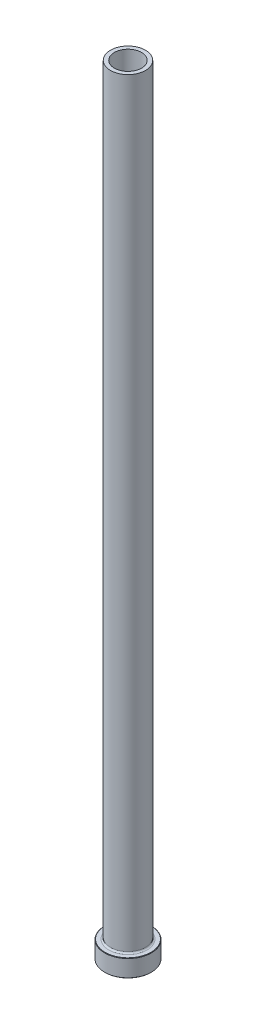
ISO-10303-21;
HEADER;
FILE_DESCRIPTION(('STEP AP214'),'2;1');
FILE_NAME('part.step','',(''),(''),'','','');
FILE_SCHEMA(('AUTOMOTIVE_DESIGN { 1 0 10303 214 1 1 1 1 }'));
ENDSEC;
DATA;
#1=APPLICATION_CONTEXT('core data for automotive mechanical design processes');
#2=APPLICATION_PROTOCOL_DEFINITION('international standard','automotive_design',2000,#1);
#3=PRODUCT_CONTEXT('',#1,'mechanical');
#4=PRODUCT('Part','Part','',(#3));
#5=PRODUCT_RELATED_PRODUCT_CATEGORY('part','',(#4));
#6=PRODUCT_DEFINITION_FORMATION('','',#4);
#7=PRODUCT_DEFINITION_CONTEXT('part definition',#1,'design');
#8=PRODUCT_DEFINITION('design','',#6,#7);
#9=PRODUCT_DEFINITION_SHAPE('','',#8);
#10=(LENGTH_UNIT() NAMED_UNIT(*) SI_UNIT(.MILLI.,.METRE.));
#11=(NAMED_UNIT(*) PLANE_ANGLE_UNIT() SI_UNIT($,.RADIAN.));
#12=(NAMED_UNIT(*) SI_UNIT($,.STERADIAN.) SOLID_ANGLE_UNIT());
#13=UNCERTAINTY_MEASURE_WITH_UNIT(LENGTH_MEASURE(1.E-05),#10,'distance_accuracy_value','');
#14=(GEOMETRIC_REPRESENTATION_CONTEXT(3) GLOBAL_UNCERTAINTY_ASSIGNED_CONTEXT((#13)) GLOBAL_UNIT_ASSIGNED_CONTEXT((#10,
#11,#12)) REPRESENTATION_CONTEXT('',''));
#15=CARTESIAN_POINT('',(0.,0.,0.));
#16=DIRECTION('',(0.,0.,1.));
#17=DIRECTION('',(1.,0.,0.));
#18=AXIS2_PLACEMENT_3D('',#15,#16,#17);
#19=CARTESIAN_POINT('',(0.,92.1876809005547,0.));
#20=DIRECTION('',(0.,1.,0.));
#21=DIRECTION('',(0.,0.,1.));
#22=AXIS2_PLACEMENT_3D('',#19,#20,#21);
#23=CYLINDRICAL_SURFACE('',#22,7.00000000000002);
#24=CARTESIAN_POINT('',(0.,400.,0.));
#25=DIRECTION('',(0.,1.,0.));
#26=DIRECTION('',(0.,0.,1.));
#27=AXIS2_PLACEMENT_3D('',#24,#25,#26);
#28=CIRCLE('',#27,7.00000000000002);
#29=CARTESIAN_POINT('',(0.,400.,7.00000000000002));
#30=VERTEX_POINT('',#29);
#31=EDGE_CURVE('E62',#30,#30,#28,.T.);
#32=ORIENTED_EDGE('',*,*,#31,.T.);
#33=EDGE_LOOP('',(#32));
#34=FACE_BOUND('',#33,.T.);
#35=CARTESIAN_POINT('',(0.,345.,0.));
#36=DIRECTION('',(0.,1.,0.));
#37=DIRECTION('',(0.,0.,1.));
#38=AXIS2_PLACEMENT_3D('',#35,#36,#37);
#39=CIRCLE('',#38,7.00000000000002);
#40=CARTESIAN_POINT('',(0.,345.,7.00000000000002));
#41=VERTEX_POINT('',#40);
#42=EDGE_CURVE('E71',#41,#41,#39,.T.);
#43=ORIENTED_EDGE('',*,*,#42,.F.);
#44=EDGE_LOOP('',(#43));
#45=FACE_BOUND('',#44,.T.);
#46=ADVANCED_FACE('F30',(#34,#45),#23,.F.);
#47=CARTESIAN_POINT('',(-7.00000000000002,400.,0.));
#48=DIRECTION('',(0.,1.,0.));
#49=DIRECTION('',(0.,0.,1.));
#50=AXIS2_PLACEMENT_3D('',#47,#48,#49);
#51=PLANE('',#50);
#52=CARTESIAN_POINT('',(0.,400.,0.));
#53=DIRECTION('',(0.,1.,0.));
#54=DIRECTION('',(0.,0.,1.));
#55=AXIS2_PLACEMENT_3D('',#52,#53,#54);
#56=CIRCLE('',#55,9.00000000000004);
#57=CARTESIAN_POINT('',(0.,400.,9.00000000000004));
#58=VERTEX_POINT('',#57);
#59=EDGE_CURVE('E65',#58,#58,#56,.T.);
#60=ORIENTED_EDGE('',*,*,#59,.T.);
#61=EDGE_LOOP('',(#60));
#62=FACE_BOUND('',#61,.T.);
#63=ORIENTED_EDGE('',*,*,#31,.F.);
#64=EDGE_LOOP('',(#63));
#65=FACE_BOUND('',#64,.T.);
#66=ADVANCED_FACE('F79',(#62,#65),#51,.T.);
#67=CARTESIAN_POINT('',(0.,92.1876809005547,0.));
#68=DIRECTION('',(0.,1.,0.));
#69=DIRECTION('',(0.,0.,1.));
#70=AXIS2_PLACEMENT_3D('',#67,#68,#69);
#71=CYLINDRICAL_SURFACE('',#70,9.00000000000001);
#72=CARTESIAN_POINT('',(0.,9.8,0.));
#73=DIRECTION('',(0.,1.,0.));
#74=DIRECTION('',(0.,0.,1.));
#75=AXIS2_PLACEMENT_3D('',#72,#73,#74);
#76=CIRCLE('',#75,9.00000000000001);
#77=CARTESIAN_POINT('',(0.,9.8,9.00000000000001));
#78=VERTEX_POINT('',#77);
#79=EDGE_CURVE('E59',#78,#78,#76,.T.);
#80=ORIENTED_EDGE('',*,*,#79,.T.);
#81=EDGE_LOOP('',(#80));
#82=FACE_BOUND('',#81,.T.);
#83=ORIENTED_EDGE('',*,*,#59,.F.);
#84=EDGE_LOOP('',(#83));
#85=FACE_BOUND('',#84,.T.);
#86=ADVANCED_FACE('F85',(#82,#85),#71,.T.);
#87=CARTESIAN_POINT('',(-8.99999999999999,9.,0.));
#88=DIRECTION('',(0.,1.,0.));
#89=DIRECTION('',(0.,0.,1.));
#90=AXIS2_PLACEMENT_3D('',#87,#88,#89);
#91=PLANE('',#90);
#92=CARTESIAN_POINT('',(0.,9.,0.));
#93=DIRECTION('',(0.,1.,0.));
#94=DIRECTION('',(0.,0.,1.));
#95=AXIS2_PLACEMENT_3D('',#92,#93,#94);
#96=CIRCLE('',#95,11.7999999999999);
#97=CARTESIAN_POINT('',(0.,9.,11.7999999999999));
#98=VERTEX_POINT('',#97);
#99=EDGE_CURVE('E53',#98,#98,#96,.T.);
#100=ORIENTED_EDGE('',*,*,#99,.T.);
#101=EDGE_LOOP('',(#100));
#102=FACE_BOUND('',#101,.T.);
#103=CARTESIAN_POINT('',(0.,9.,0.));
#104=DIRECTION('',(0.,1.,0.));
#105=DIRECTION('',(0.,0.,1.));
#106=AXIS2_PLACEMENT_3D('',#103,#104,#105);
#107=CIRCLE('',#106,9.80000000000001);
#108=CARTESIAN_POINT('',(0.,9.,9.80000000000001));
#109=VERTEX_POINT('',#108);
#110=EDGE_CURVE('E56',#109,#109,#107,.F.);
#111=ORIENTED_EDGE('',*,*,#110,.T.);
#112=EDGE_LOOP('',(#111));
#113=FACE_BOUND('',#112,.T.);
#114=ADVANCED_FACE('F111',(#102,#113),#91,.T.);
#115=CARTESIAN_POINT('',(0.,92.1876809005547,0.));
#116=DIRECTION('',(0.,1.,0.));
#117=DIRECTION('',(0.,0.,1.));
#118=AXIS2_PLACEMENT_3D('',#115,#116,#117);
#119=CYLINDRICAL_SURFACE('',#118,12.);
#120=CARTESIAN_POINT('',(0.,8.79999999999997,0.));
#121=DIRECTION('',(0.,1.,0.));
#122=DIRECTION('',(0.,0.,1.));
#123=AXIS2_PLACEMENT_3D('',#120,#121,#122);
#124=CIRCLE('',#123,12.);
#125=CARTESIAN_POINT('',(0.,8.79999999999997,12.));
#126=VERTEX_POINT('',#125);
#127=EDGE_CURVE('E45',#126,#126,#124,.F.);
#128=ORIENTED_EDGE('',*,*,#127,.T.);
#129=EDGE_LOOP('',(#128));
#130=FACE_BOUND('',#129,.T.);
#131=CARTESIAN_POINT('',(0.,0.199999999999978,0.));
#132=DIRECTION('',(0.,-1.,0.));
#133=DIRECTION('',(0.,0.,-1.));
#134=AXIS2_PLACEMENT_3D('',#131,#132,#133);
#135=CIRCLE('',#134,12.);
#136=CARTESIAN_POINT('',(0.,0.199999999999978,12.));
#137=VERTEX_POINT('',#136);
#138=EDGE_CURVE('E50',#137,#137,#135,.F.);
#139=ORIENTED_EDGE('',*,*,#138,.T.);
#140=EDGE_LOOP('',(#139));
#141=FACE_BOUND('',#140,.T.);
#142=ADVANCED_FACE('F108',(#130,#141),#119,.T.);
#143=CARTESIAN_POINT('',(-12.,0.,0.));
#144=DIRECTION('',(0.,-1.,0.));
#145=DIRECTION('',(0.,0.,-1.));
#146=AXIS2_PLACEMENT_3D('',#143,#144,#145);
#147=PLANE('',#146);
#148=CARTESIAN_POINT('',(0.,0.,0.));
#149=DIRECTION('',(0.,-1.,0.));
#150=DIRECTION('',(0.,0.,-1.));
#151=AXIS2_PLACEMENT_3D('',#148,#149,#150);
#152=CIRCLE('',#151,7.75000000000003);
#153=CARTESIAN_POINT('',(0.,0.,-7.75000000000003));
#154=VERTEX_POINT('',#153);
#155=EDGE_CURVE('E37',#154,#154,#152,.F.);
#156=ORIENTED_EDGE('',*,*,#155,.T.);
#157=EDGE_LOOP('',(#156));
#158=FACE_BOUND('',#157,.T.);
#159=CARTESIAN_POINT('',(0.,0.,0.));
#160=DIRECTION('',(0.,-1.,0.));
#161=DIRECTION('',(0.,0.,-1.));
#162=AXIS2_PLACEMENT_3D('',#159,#160,#161);
#163=CIRCLE('',#162,11.8);
#164=CARTESIAN_POINT('',(0.,0.,11.8));
#165=VERTEX_POINT('',#164);
#166=EDGE_CURVE('E41',#165,#165,#163,.T.);
#167=ORIENTED_EDGE('',*,*,#166,.T.);
#168=EDGE_LOOP('',(#167));
#169=FACE_BOUND('',#168,.T.);
#170=ADVANCED_FACE('F110',(#158,#169),#147,.T.);
#171=CARTESIAN_POINT('',(0.,92.1876809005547,0.));
#172=DIRECTION('',(0.,1.,0.));
#173=DIRECTION('',(0.,0.,1.));
#174=AXIS2_PLACEMENT_3D('',#171,#172,#173);
#175=CYLINDRICAL_SURFACE('',#174,7.25000000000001);
#176=CARTESIAN_POINT('',(0.,0.5,0.));
#177=DIRECTION('',(0.,-1.,0.));
#178=DIRECTION('',(0.,0.,-1.));
#179=AXIS2_PLACEMENT_3D('',#176,#177,#178);
#180=CIRCLE('',#179,7.25000000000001);
#181=CARTESIAN_POINT('',(0.,0.5,-7.25000000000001));
#182=VERTEX_POINT('',#181);
#183=EDGE_CURVE('E10',#182,#182,#180,.T.);
#184=ORIENTED_EDGE('',*,*,#183,.T.);
#185=EDGE_LOOP('',(#184));
#186=FACE_BOUND('',#185,.T.);
#187=CARTESIAN_POINT('',(0.,333.,0.));
#188=DIRECTION('',(0.,1.,0.));
#189=DIRECTION('',(0.,0.,1.));
#190=AXIS2_PLACEMENT_3D('',#187,#188,#189);
#191=CIRCLE('',#190,7.25000000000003);
#192=CARTESIAN_POINT('',(0.,333.,7.25000000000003));
#193=VERTEX_POINT('',#192);
#194=EDGE_CURVE('E68',#193,#193,#191,.T.);
#195=ORIENTED_EDGE('',*,*,#194,.T.);
#196=EDGE_LOOP('',(#195));
#197=FACE_BOUND('',#196,.T.);
#198=ADVANCED_FACE('F118',(#186,#197),#175,.F.);
#199=CARTESIAN_POINT('',(0.,333.,0.));
#200=DIRECTION('',(0.,-1.,0.));
#201=DIRECTION('',(0.,0.,-1.));
#202=AXIS2_PLACEMENT_3D('',#199,#200,#201);
#203=CONICAL_SURFACE('',#202,7.25000000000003,0.0208303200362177);
#204=ORIENTED_EDGE('',*,*,#42,.T.);
#205=EDGE_LOOP('',(#204));
#206=FACE_BOUND('',#205,.T.);
#207=ORIENTED_EDGE('',*,*,#194,.F.);
#208=EDGE_LOOP('',(#207));
#209=FACE_BOUND('',#208,.T.);
#210=ADVANCED_FACE('F75',(#206,#209),#203,.F.);
#211=CARTESIAN_POINT('',(0.,9.8,0.));
#212=DIRECTION('',(0.,1.,0.));
#213=DIRECTION('',(0.,0.,1.));
#214=AXIS2_PLACEMENT_3D('',#211,#212,#213);
#215=TOROIDAL_SURFACE('',#214,9.80000000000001,0.8);
#216=ORIENTED_EDGE('',*,*,#110,.F.);
#217=EDGE_LOOP('',(#216));
#218=FACE_BOUND('',#217,.T.);
#219=ORIENTED_EDGE('',*,*,#79,.F.);
#220=EDGE_LOOP('',(#219));
#221=FACE_BOUND('',#220,.T.);
#222=ADVANCED_FACE('F90',(#218,#221),#215,.F.);
#223=CARTESIAN_POINT('',(0.,9.00000000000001,0.));
#224=DIRECTION('',(0.,-1.,0.));
#225=DIRECTION('',(0.,0.,-1.));
#226=AXIS2_PLACEMENT_3D('',#223,#224,#225);
#227=CONICAL_SURFACE('',#226,11.7999999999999,0.785398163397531);
#228=ORIENTED_EDGE('',*,*,#127,.F.);
#229=EDGE_LOOP('',(#228));
#230=FACE_BOUND('',#229,.T.);
#231=ORIENTED_EDGE('',*,*,#99,.F.);
#232=EDGE_LOOP('',(#231));
#233=FACE_BOUND('',#232,.T.);
#234=ADVANCED_FACE('F93',(#230,#233),#227,.T.);
#235=CARTESIAN_POINT('',(0.,0.199999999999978,0.));
#236=DIRECTION('',(0.,1.,0.));
#237=DIRECTION('',(0.,0.,1.));
#238=AXIS2_PLACEMENT_3D('',#235,#236,#237);
#239=CONICAL_SURFACE('',#238,12.,0.785398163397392);
#240=CARTESIAN_POINT('',(0.,0.,11.8));
#241=CARTESIAN_POINT('',(0.,0.00208333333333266,11.8020833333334));
#242=CARTESIAN_POINT('',(0.,0.00416666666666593,11.8041666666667));
#243=CARTESIAN_POINT('',(0.,0.00833333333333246,11.8083333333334));
#244=CARTESIAN_POINT('',(0.,0.0104166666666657,11.8104166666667));
#245=CARTESIAN_POINT('',(0.,0.0145833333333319,11.8145833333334));
#246=CARTESIAN_POINT('',(0.,0.0166666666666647,11.8166666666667));
#247=CARTESIAN_POINT('',(0.,0.0208333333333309,11.8208333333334));
#248=CARTESIAN_POINT('',(0.,0.0229166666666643,11.8229166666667));
#249=CARTESIAN_POINT('',(0.,0.0270833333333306,11.8270833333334));
#250=CARTESIAN_POINT('',(0.,0.0291666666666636,11.8291666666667));
#251=CARTESIAN_POINT('',(0.,0.0333333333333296,11.8333333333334));
#252=CARTESIAN_POINT('',(0.,0.0354166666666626,11.8354166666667));
#253=CARTESIAN_POINT('',(0.,0.0395833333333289,11.8395833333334));
#254=CARTESIAN_POINT('',(0.,0.0416666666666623,11.8416666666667));
#255=CARTESIAN_POINT('',(0.,0.0458333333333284,11.8458333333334));
#256=CARTESIAN_POINT('',(0.,0.0479166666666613,11.8479166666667));
#257=CARTESIAN_POINT('',(0.,0.0520833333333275,11.8520833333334));
#258=CARTESIAN_POINT('',(0.,0.0541666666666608,11.8541666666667));
#259=CARTESIAN_POINT('',(0.,0.0583333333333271,11.8583333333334));
#260=CARTESIAN_POINT('',(0.,0.0604166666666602,11.8604166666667));
#261=CARTESIAN_POINT('',(0.,0.0645833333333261,11.8645833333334));
#262=CARTESIAN_POINT('',(0.,0.0666666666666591,11.8666666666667));
#263=CARTESIAN_POINT('',(0.,0.0708333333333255,11.8708333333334));
#264=CARTESIAN_POINT('',(0.,0.0729166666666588,11.8729166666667));
#265=CARTESIAN_POINT('',(0.,0.077083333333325,11.8770833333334));
#266=CARTESIAN_POINT('',(0.,0.0791666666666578,11.8791666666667));
#267=CARTESIAN_POINT('',(0.,0.083333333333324,11.8833333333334));
#268=CARTESIAN_POINT('',(0.,0.0854166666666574,11.8854166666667));
#269=CARTESIAN_POINT('',(0.,0.0895833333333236,11.8895833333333));
#270=CARTESIAN_POINT('',(0.,0.0916666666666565,11.8916666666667));
#271=CARTESIAN_POINT('',(0.,0.0958333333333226,11.8958333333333));
#272=CARTESIAN_POINT('',(0.,0.097916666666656,11.8979166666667));
#273=CARTESIAN_POINT('',(0.,0.102083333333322,11.9020833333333));
#274=CARTESIAN_POINT('',(0.,0.104166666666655,11.9041666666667));
#275=CARTESIAN_POINT('',(0.,0.108333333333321,11.9083333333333));
#276=CARTESIAN_POINT('',(0.,0.110416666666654,11.9104166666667));
#277=CARTESIAN_POINT('',(0.,0.114583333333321,11.9145833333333));
#278=CARTESIAN_POINT('',(0.,0.116666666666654,11.9166666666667));
#279=CARTESIAN_POINT('',(0.,0.12083333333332,11.9208333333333));
#280=CARTESIAN_POINT('',(0.,0.122916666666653,11.9229166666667));
#281=CARTESIAN_POINT('',(0.,0.127083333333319,11.9270833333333));
#282=CARTESIAN_POINT('',(0.,0.129166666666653,11.9291666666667));
#283=CARTESIAN_POINT('',(0.,0.133333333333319,11.9333333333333));
#284=CARTESIAN_POINT('',(0.,0.135416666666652,11.9354166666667));
#285=CARTESIAN_POINT('',(0.,0.139583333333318,11.9395833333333));
#286=CARTESIAN_POINT('',(0.,0.141666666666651,11.9416666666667));
#287=CARTESIAN_POINT('',(0.,0.145833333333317,11.9458333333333));
#288=CARTESIAN_POINT('',(0.,0.147916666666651,11.9479166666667));
#289=CARTESIAN_POINT('',(0.,0.152083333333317,11.9520833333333));
#290=CARTESIAN_POINT('',(0.,0.15416666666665,11.9541666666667));
#291=CARTESIAN_POINT('',(0.,0.158333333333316,11.9583333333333));
#292=CARTESIAN_POINT('',(0.,0.160416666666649,11.9604166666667));
#293=CARTESIAN_POINT('',(0.,0.164583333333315,11.9645833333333));
#294=CARTESIAN_POINT('',(0.,0.166666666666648,11.9666666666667));
#295=CARTESIAN_POINT('',(0.,0.170833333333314,11.9708333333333));
#296=CARTESIAN_POINT('',(0.,0.172916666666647,11.9729166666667));
#297=CARTESIAN_POINT('',(0.,0.177083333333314,11.9770833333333));
#298=CARTESIAN_POINT('',(0.,0.179166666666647,11.9791666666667));
#299=CARTESIAN_POINT('',(0.,0.183333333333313,11.9833333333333));
#300=CARTESIAN_POINT('',(0.,0.185416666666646,11.9854166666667));
#301=CARTESIAN_POINT('',(0.,0.189583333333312,11.9895833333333));
#302=CARTESIAN_POINT('',(0.,0.191666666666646,11.9916666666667));
#303=CARTESIAN_POINT('',(0.,0.195833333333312,11.9958333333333));
#304=CARTESIAN_POINT('',(0.,0.197916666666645,11.9979166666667));
#305=CARTESIAN_POINT('',(0.,0.199999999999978,12.));
#306=B_SPLINE_CURVE_WITH_KNOTS('',3,(#240,#241,#242,#243,#244,#245,#246,#247,#248,#249,#250,
#251,#252,#253,#254,#255,#256,#257,#258,#259,#260,#261,#262,#263,#264,#265,#266,#267,#268,#269,
#270,#271,#272,#273,#274,#275,#276,#277,#278,#279,#280,#281,#282,#283,#284,#285,#286,#287,#288,
#289,#290,#291,#292,#293,#294,#295,#296,#297,#298,#299,#300,#301,#302,#303,#304,#305),
.UNSPECIFIED.,.F.,.F.,(4,2,2,2,2,2,2,2,2,2,2,2,2,2,2,2,2,2,2,2,2,2,2,2,2,2,2,2,2,2,2,2,4),(0.,
0.00883883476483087,0.0176776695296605,0.0265165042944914,0.035355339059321,0.0441941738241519,
0.0530330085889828,0.0618718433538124,0.0707106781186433,0.0795495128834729,0.0883883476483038,
0.0972271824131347,0.106066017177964,0.114904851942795,0.123743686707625,0.132582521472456,
0.141421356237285,0.150260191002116,0.159099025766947,0.167937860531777,0.176776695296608,
0.185615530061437,0.194454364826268,0.203293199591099,0.212132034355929,0.220970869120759,
0.229809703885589,0.23864853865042,0.247487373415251,0.25632620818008,0.265165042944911,
0.274003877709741,0.282842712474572),.UNSPECIFIED.);
#307=EDGE_CURVE('BSEAM96',#165,#137,#306,.T.);
#308=ORIENTED_EDGE('',*,*,#166,.F.);
#309=ORIENTED_EDGE('',*,*,#138,.F.);
#310=ORIENTED_EDGE('',*,*,#307,.T.);
#311=ORIENTED_EDGE('',*,*,#307,.F.);
#312=EDGE_LOOP('',(#308,#310,#309,#311));
#313=FACE_BOUND('',#312,.T.);
#314=ADVANCED_FACE('F96',(#313),#239,.T.);
#315=CARTESIAN_POINT('',(0.,0.,0.));
#316=DIRECTION('',(0.,-1.,0.));
#317=DIRECTION('',(0.,0.,-1.));
#318=AXIS2_PLACEMENT_3D('',#315,#316,#317);
#319=CONICAL_SURFACE('',#318,7.75000000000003,0.785398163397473);
#320=ORIENTED_EDGE('',*,*,#183,.F.);
#321=EDGE_LOOP('',(#320));
#322=FACE_BOUND('',#321,.T.);
#323=ORIENTED_EDGE('',*,*,#155,.F.);
#324=EDGE_LOOP('',(#323));
#325=FACE_BOUND('',#324,.T.);
#326=ADVANCED_FACE('F32',(#322,#325),#319,.F.);
#327=CLOSED_SHELL('',(#46,#66,#86,#114,#142,#170,#198,#210,#222,#234,#314,#326));
#328=MANIFOLD_SOLID_BREP('B2',#327);
#329=ADVANCED_BREP_SHAPE_REPRESENTATION('',(#18,#328),#14);
#330=SHAPE_DEFINITION_REPRESENTATION(#9,#329);
ENDSEC;
END-ISO-10303-21;
